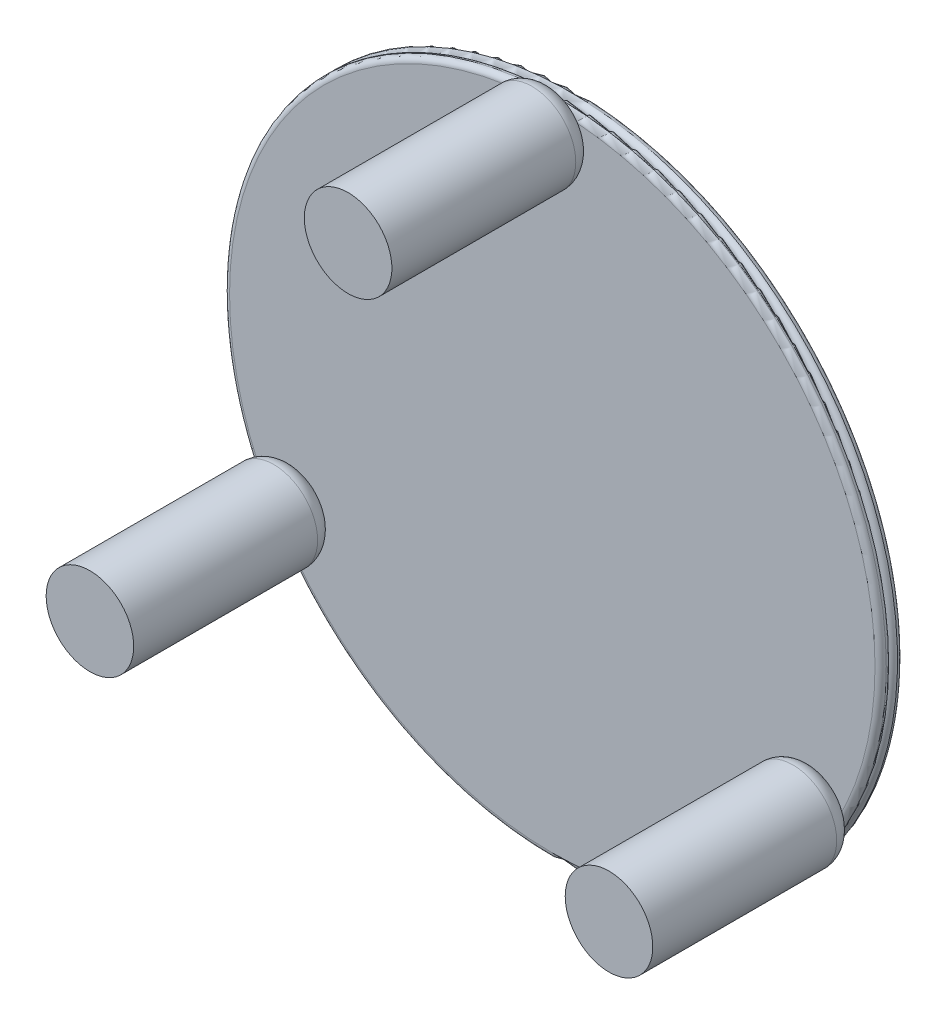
ISO-10303-21;
HEADER;
FILE_DESCRIPTION(('STEP AP214'),'2;1');
FILE_NAME('part.step','',(''),(''),'','','');
FILE_SCHEMA(('AUTOMOTIVE_DESIGN { 1 0 10303 214 1 1 1 1 }'));
ENDSEC;
DATA;
#1=APPLICATION_CONTEXT('core data for automotive mechanical design processes');
#2=APPLICATION_PROTOCOL_DEFINITION('international standard','automotive_design',2000,#1);
#3=PRODUCT_CONTEXT('',#1,'mechanical');
#4=PRODUCT('Part','Part','',(#3));
#5=PRODUCT_RELATED_PRODUCT_CATEGORY('part','',(#4));
#6=PRODUCT_DEFINITION_FORMATION('','',#4);
#7=PRODUCT_DEFINITION_CONTEXT('part definition',#1,'design');
#8=PRODUCT_DEFINITION('design','',#6,#7);
#9=PRODUCT_DEFINITION_SHAPE('','',#8);
#10=(LENGTH_UNIT() NAMED_UNIT(*) SI_UNIT(.MILLI.,.METRE.));
#11=(NAMED_UNIT(*) PLANE_ANGLE_UNIT() SI_UNIT($,.RADIAN.));
#12=(NAMED_UNIT(*) SI_UNIT($,.STERADIAN.) SOLID_ANGLE_UNIT());
#13=UNCERTAINTY_MEASURE_WITH_UNIT(LENGTH_MEASURE(1.E-05),#10,'distance_accuracy_value','');
#14=(GEOMETRIC_REPRESENTATION_CONTEXT(3) GLOBAL_UNCERTAINTY_ASSIGNED_CONTEXT((#13)) GLOBAL_UNIT_ASSIGNED_CONTEXT((#10,
#11,#12)) REPRESENTATION_CONTEXT('',''));
#15=CARTESIAN_POINT('',(0.,0.,0.));
#16=DIRECTION('',(0.,0.,1.));
#17=DIRECTION('',(1.,0.,0.));
#18=AXIS2_PLACEMENT_3D('',#15,#16,#17);
#19=CARTESIAN_POINT('',(-681.357062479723,-207.188704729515,18.));
#20=DIRECTION('',(0.,0.,1.));
#21=DIRECTION('',(1.,0.,0.));
#22=AXIS2_PLACEMENT_3D('',#19,#20,#21);
#23=PLANE('',#22);
#24=CARTESIAN_POINT('',(-681.357062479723,-207.188704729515,18.));
#25=DIRECTION('',(0.,0.,1.));
#26=DIRECTION('',(1.,0.,0.));
#27=AXIS2_PLACEMENT_3D('',#24,#25,#26);
#28=CIRCLE('',#27,40.0000000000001);
#29=CARTESIAN_POINT('',(-641.357062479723,-207.188704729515,18.));
#30=VERTEX_POINT('',#29);
#31=EDGE_CURVE('E11',#30,#30,#28,.F.);
#32=ORIENTED_EDGE('',*,*,#31,.T.);
#33=EDGE_LOOP('',(#32));
#34=FACE_BOUND('',#33,.T.);
#35=ADVANCED_FACE('F58',(#34),#23,.F.);
#36=CARTESIAN_POINT('',(-681.357062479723,-207.188704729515,899.989898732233));
#37=DIRECTION('',(0.,0.,-1.));
#38=DIRECTION('',(-1.,0.,0.));
#39=AXIS2_PLACEMENT_3D('',#36,#37,#38);
#40=CYLINDRICAL_SURFACE('',#39,70.0000000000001);
#41=CARTESIAN_POINT('',(-681.357062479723,-207.188704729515,47.9999999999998));
#42=DIRECTION('',(0.,0.,1.));
#43=DIRECTION('',(1.,0.,0.));
#44=AXIS2_PLACEMENT_3D('',#41,#42,#43);
#45=CIRCLE('',#44,70.0000000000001);
#46=CARTESIAN_POINT('',(-751.357062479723,-207.188704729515,47.9999999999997));
#47=VERTEX_POINT('',#46);
#48=EDGE_CURVE('E66',#47,#47,#45,.T.);
#49=CARTESIAN_POINT('',(-681.357062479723,-207.188704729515,342.));
#50=DIRECTION('',(0.,0.,-1.));
#51=DIRECTION('',(-1.,0.,0.));
#52=AXIS2_PLACEMENT_3D('',#49,#50,#51);
#53=CIRCLE('',#52,70.0000000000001);
#54=CARTESIAN_POINT('',(-751.357062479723,-207.188704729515,342.));
#55=VERTEX_POINT('',#54);
#56=EDGE_CURVE('E72',#55,#55,#53,.T.);
#57=CARTESIAN_POINT('',(-751.357062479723,-207.188704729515,47.9999999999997));
#58=CARTESIAN_POINT('',(-751.357062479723,-207.188704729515,51.0624999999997));
#59=CARTESIAN_POINT('',(-751.357062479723,-207.188704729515,54.1249999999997));
#60=CARTESIAN_POINT('',(-751.357062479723,-207.188704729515,60.2499999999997));
#61=CARTESIAN_POINT('',(-751.357062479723,-207.188704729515,63.3124999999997));
#62=CARTESIAN_POINT('',(-751.357062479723,-207.188704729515,69.4374999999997));
#63=CARTESIAN_POINT('',(-751.357062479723,-207.188704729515,72.4999999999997));
#64=CARTESIAN_POINT('',(-751.357062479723,-207.188704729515,78.6249999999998));
#65=CARTESIAN_POINT('',(-751.357062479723,-207.188704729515,81.6874999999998));
#66=CARTESIAN_POINT('',(-751.357062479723,-207.188704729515,87.8124999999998));
#67=CARTESIAN_POINT('',(-751.357062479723,-207.188704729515,90.8749999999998));
#68=CARTESIAN_POINT('',(-751.357062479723,-207.188704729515,96.9999999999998));
#69=CARTESIAN_POINT('',(-751.357062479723,-207.188704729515,100.0625));
#70=CARTESIAN_POINT('',(-751.357062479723,-207.188704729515,106.1875));
#71=CARTESIAN_POINT('',(-751.357062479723,-207.188704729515,109.25));
#72=CARTESIAN_POINT('',(-751.357062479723,-207.188704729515,115.375));
#73=CARTESIAN_POINT('',(-751.357062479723,-207.188704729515,118.4375));
#74=CARTESIAN_POINT('',(-751.357062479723,-207.188704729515,124.5625));
#75=CARTESIAN_POINT('',(-751.357062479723,-207.188704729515,127.625));
#76=CARTESIAN_POINT('',(-751.357062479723,-207.188704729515,133.75));
#77=CARTESIAN_POINT('',(-751.357062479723,-207.188704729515,136.8125));
#78=CARTESIAN_POINT('',(-751.357062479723,-207.188704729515,142.9375));
#79=CARTESIAN_POINT('',(-751.357062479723,-207.188704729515,146.));
#80=CARTESIAN_POINT('',(-751.357062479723,-207.188704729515,152.125));
#81=CARTESIAN_POINT('',(-751.357062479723,-207.188704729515,155.1875));
#82=CARTESIAN_POINT('',(-751.357062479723,-207.188704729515,161.3125));
#83=CARTESIAN_POINT('',(-751.357062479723,-207.188704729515,164.375));
#84=CARTESIAN_POINT('',(-751.357062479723,-207.188704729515,170.5));
#85=CARTESIAN_POINT('',(-751.357062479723,-207.188704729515,173.5625));
#86=CARTESIAN_POINT('',(-751.357062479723,-207.188704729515,179.6875));
#87=CARTESIAN_POINT('',(-751.357062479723,-207.188704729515,182.75));
#88=CARTESIAN_POINT('',(-751.357062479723,-207.188704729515,188.875));
#89=CARTESIAN_POINT('',(-751.357062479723,-207.188704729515,191.9375));
#90=CARTESIAN_POINT('',(-751.357062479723,-207.188704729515,198.0625));
#91=CARTESIAN_POINT('',(-751.357062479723,-207.188704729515,201.125));
#92=CARTESIAN_POINT('',(-751.357062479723,-207.188704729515,207.25));
#93=CARTESIAN_POINT('',(-751.357062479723,-207.188704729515,210.3125));
#94=CARTESIAN_POINT('',(-751.357062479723,-207.188704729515,216.4375));
#95=CARTESIAN_POINT('',(-751.357062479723,-207.188704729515,219.5));
#96=CARTESIAN_POINT('',(-751.357062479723,-207.188704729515,225.625));
#97=CARTESIAN_POINT('',(-751.357062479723,-207.188704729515,228.6875));
#98=CARTESIAN_POINT('',(-751.357062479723,-207.188704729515,234.8125));
#99=CARTESIAN_POINT('',(-751.357062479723,-207.188704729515,237.875));
#100=CARTESIAN_POINT('',(-751.357062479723,-207.188704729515,244.));
#101=CARTESIAN_POINT('',(-751.357062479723,-207.188704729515,247.0625));
#102=CARTESIAN_POINT('',(-751.357062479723,-207.188704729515,253.1875));
#103=CARTESIAN_POINT('',(-751.357062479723,-207.188704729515,256.25));
#104=CARTESIAN_POINT('',(-751.357062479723,-207.188704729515,262.375));
#105=CARTESIAN_POINT('',(-751.357062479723,-207.188704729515,265.4375));
#106=CARTESIAN_POINT('',(-751.357062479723,-207.188704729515,271.5625));
#107=CARTESIAN_POINT('',(-751.357062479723,-207.188704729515,274.625));
#108=CARTESIAN_POINT('',(-751.357062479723,-207.188704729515,280.75));
#109=CARTESIAN_POINT('',(-751.357062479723,-207.188704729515,283.8125));
#110=CARTESIAN_POINT('',(-751.357062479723,-207.188704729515,289.9375));
#111=CARTESIAN_POINT('',(-751.357062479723,-207.188704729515,293.));
#112=CARTESIAN_POINT('',(-751.357062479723,-207.188704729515,299.125));
#113=CARTESIAN_POINT('',(-751.357062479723,-207.188704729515,302.1875));
#114=CARTESIAN_POINT('',(-751.357062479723,-207.188704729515,308.3125));
#115=CARTESIAN_POINT('',(-751.357062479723,-207.188704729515,311.375));
#116=CARTESIAN_POINT('',(-751.357062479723,-207.188704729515,317.5));
#117=CARTESIAN_POINT('',(-751.357062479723,-207.188704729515,320.5625));
#118=CARTESIAN_POINT('',(-751.357062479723,-207.188704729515,326.6875));
#119=CARTESIAN_POINT('',(-751.357062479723,-207.188704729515,329.75));
#120=CARTESIAN_POINT('',(-751.357062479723,-207.188704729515,335.875));
#121=CARTESIAN_POINT('',(-751.357062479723,-207.188704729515,338.9375));
#122=CARTESIAN_POINT('',(-751.357062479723,-207.188704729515,342.));
#123=B_SPLINE_CURVE_WITH_KNOTS('',3,(#57,#58,#59,#60,#61,#62,#63,#64,#65,#66,#67,#68,#69,#70,
#71,#72,#73,#74,#75,#76,#77,#78,#79,#80,#81,#82,#83,#84,#85,#86,#87,#88,#89,#90,#91,#92,#93,#94,
#95,#96,#97,#98,#99,#100,#101,#102,#103,#104,#105,#106,#107,#108,#109,#110,#111,#112,#113,#114,
#115,#116,#117,#118,#119,#120,#121,#122),.UNSPECIFIED.,.F.,.F.,(4,2,2,2,2,2,2,2,2,2,2,2,2,2,2,2,
2,2,2,2,2,2,2,2,2,2,2,2,2,2,2,2,4),(0.,9.18750000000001,18.375,27.5625,36.7500000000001,
45.9375000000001,55.1250000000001,64.3125,73.5000000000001,82.6875,91.875,101.0625,110.25,
119.4375,128.625,137.8125,147.,156.1875,165.375,174.5625,183.75,192.9375,202.125,211.3125,220.5,
229.6875,238.875,248.0625,257.25,266.4375,275.625,284.8125,294.),.UNSPECIFIED.);
#124=EDGE_CURVE('BSEAM79',#47,#55,#123,.T.);
#125=ORIENTED_EDGE('',*,*,#48,.T.);
#126=ORIENTED_EDGE('',*,*,#56,.T.);
#127=ORIENTED_EDGE('',*,*,#124,.T.);
#128=ORIENTED_EDGE('',*,*,#124,.F.);
#129=EDGE_LOOP('',(#125,#127,#126,#128));
#130=FACE_BOUND('',#129,.T.);
#131=ADVANCED_FACE('F79',(#130),#40,.T.);
#132=CARTESIAN_POINT('',(-266.11981026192,33.5975581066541,342.));
#133=DIRECTION('',(0.,0.,-1.));
#134=DIRECTION('',(-1.,0.,0.));
#135=AXIS2_PLACEMENT_3D('',#132,#133,#134);
#136=PLANE('',#135);
#137=ORIENTED_EDGE('',*,*,#56,.F.);
#138=EDGE_LOOP('',(#137));
#139=FACE_BOUND('',#138,.T.);
#140=ADVANCED_FACE('F81',(#139),#136,.F.);
#141=CARTESIAN_POINT('',(-681.357062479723,-207.188704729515,48.));
#142=DIRECTION('',(0.,0.,1.));
#143=DIRECTION('',(1.,0.,0.));
#144=AXIS2_PLACEMENT_3D('',#141,#142,#143);
#145=TOROIDAL_SURFACE('',#144,40.0000000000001,30.);
#146=ORIENTED_EDGE('',*,*,#31,.F.);
#147=EDGE_LOOP('',(#146));
#148=FACE_BOUND('',#147,.T.);
#149=ORIENTED_EDGE('',*,*,#48,.F.);
#150=EDGE_LOOP('',(#149));
#151=FACE_BOUND('',#150,.T.);
#152=ADVANCED_FACE('F60',(#148,#151),#145,.T.);
#153=CLOSED_SHELL('',(#35,#131,#140,#152));
#154=MANIFOLD_SOLID_BREP('B2',#153);
#155=CARTESIAN_POINT('',(148.561038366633,-208.145681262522,18.));
#156=DIRECTION('',(0.,0.,1.));
#157=DIRECTION('',(1.,0.,0.));
#158=AXIS2_PLACEMENT_3D('',#155,#156,#157);
#159=PLANE('',#158);
#160=CARTESIAN_POINT('',(148.561038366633,-208.145681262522,18.));
#161=DIRECTION('',(0.,0.,1.));
#162=DIRECTION('',(1.,0.,0.));
#163=AXIS2_PLACEMENT_3D('',#160,#161,#162);
#164=CIRCLE('',#163,40.);
#165=CARTESIAN_POINT('',(188.561038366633,-208.145681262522,18.));
#166=VERTEX_POINT('',#165);
#167=EDGE_CURVE('E57',#166,#166,#164,.F.);
#168=ORIENTED_EDGE('',*,*,#167,.T.);
#169=EDGE_LOOP('',(#168));
#170=FACE_BOUND('',#169,.T.);
#171=ADVANCED_FACE('F129',(#170),#159,.F.);
#172=CARTESIAN_POINT('',(148.561038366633,-208.145681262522,899.989898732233));
#173=DIRECTION('',(0.,0.,-1.));
#174=DIRECTION('',(-1.,0.,0.));
#175=AXIS2_PLACEMENT_3D('',#172,#173,#174);
#176=CYLINDRICAL_SURFACE('',#175,70.);
#177=CARTESIAN_POINT('',(148.561038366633,-208.145681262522,47.9999999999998));
#178=DIRECTION('',(0.,0.,1.));
#179=DIRECTION('',(1.,0.,0.));
#180=AXIS2_PLACEMENT_3D('',#177,#178,#179);
#181=CIRCLE('',#180,70.);
#182=CARTESIAN_POINT('',(78.5610383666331,-208.145681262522,47.9999999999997));
#183=VERTEX_POINT('',#182);
#184=EDGE_CURVE('E137',#183,#183,#181,.T.);
#185=CARTESIAN_POINT('',(148.561038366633,-208.145681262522,342.));
#186=DIRECTION('',(0.,0.,-1.));
#187=DIRECTION('',(-1.,0.,0.));
#188=AXIS2_PLACEMENT_3D('',#185,#186,#187);
#189=CIRCLE('',#188,70.);
#190=CARTESIAN_POINT('',(78.5610383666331,-208.145681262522,342.));
#191=VERTEX_POINT('',#190);
#192=EDGE_CURVE('E143',#191,#191,#189,.T.);
#193=CARTESIAN_POINT('',(78.5610383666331,-208.145681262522,47.9999999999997));
#194=CARTESIAN_POINT('',(78.5610383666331,-208.145681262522,51.0624999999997));
#195=CARTESIAN_POINT('',(78.5610383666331,-208.145681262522,54.1249999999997));
#196=CARTESIAN_POINT('',(78.5610383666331,-208.145681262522,60.2499999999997));
#197=CARTESIAN_POINT('',(78.5610383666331,-208.145681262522,63.3124999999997));
#198=CARTESIAN_POINT('',(78.5610383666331,-208.145681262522,69.4374999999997));
#199=CARTESIAN_POINT('',(78.5610383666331,-208.145681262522,72.4999999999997));
#200=CARTESIAN_POINT('',(78.5610383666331,-208.145681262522,78.6249999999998));
#201=CARTESIAN_POINT('',(78.5610383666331,-208.145681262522,81.6874999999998));
#202=CARTESIAN_POINT('',(78.5610383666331,-208.145681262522,87.8124999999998));
#203=CARTESIAN_POINT('',(78.5610383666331,-208.145681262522,90.8749999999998));
#204=CARTESIAN_POINT('',(78.5610383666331,-208.145681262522,96.9999999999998));
#205=CARTESIAN_POINT('',(78.5610383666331,-208.145681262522,100.0625));
#206=CARTESIAN_POINT('',(78.5610383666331,-208.145681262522,106.1875));
#207=CARTESIAN_POINT('',(78.5610383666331,-208.145681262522,109.25));
#208=CARTESIAN_POINT('',(78.5610383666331,-208.145681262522,115.375));
#209=CARTESIAN_POINT('',(78.5610383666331,-208.145681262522,118.4375));
#210=CARTESIAN_POINT('',(78.5610383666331,-208.145681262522,124.5625));
#211=CARTESIAN_POINT('',(78.5610383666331,-208.145681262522,127.625));
#212=CARTESIAN_POINT('',(78.5610383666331,-208.145681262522,133.75));
#213=CARTESIAN_POINT('',(78.5610383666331,-208.145681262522,136.8125));
#214=CARTESIAN_POINT('',(78.5610383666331,-208.145681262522,142.9375));
#215=CARTESIAN_POINT('',(78.5610383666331,-208.145681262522,146.));
#216=CARTESIAN_POINT('',(78.5610383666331,-208.145681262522,152.125));
#217=CARTESIAN_POINT('',(78.5610383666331,-208.145681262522,155.1875));
#218=CARTESIAN_POINT('',(78.5610383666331,-208.145681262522,161.3125));
#219=CARTESIAN_POINT('',(78.5610383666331,-208.145681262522,164.375));
#220=CARTESIAN_POINT('',(78.5610383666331,-208.145681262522,170.5));
#221=CARTESIAN_POINT('',(78.5610383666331,-208.145681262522,173.5625));
#222=CARTESIAN_POINT('',(78.5610383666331,-208.145681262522,179.6875));
#223=CARTESIAN_POINT('',(78.5610383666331,-208.145681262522,182.75));
#224=CARTESIAN_POINT('',(78.5610383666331,-208.145681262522,188.875));
#225=CARTESIAN_POINT('',(78.5610383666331,-208.145681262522,191.9375));
#226=CARTESIAN_POINT('',(78.5610383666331,-208.145681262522,198.0625));
#227=CARTESIAN_POINT('',(78.5610383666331,-208.145681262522,201.125));
#228=CARTESIAN_POINT('',(78.5610383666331,-208.145681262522,207.25));
#229=CARTESIAN_POINT('',(78.5610383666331,-208.145681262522,210.3125));
#230=CARTESIAN_POINT('',(78.5610383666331,-208.145681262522,216.4375));
#231=CARTESIAN_POINT('',(78.5610383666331,-208.145681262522,219.5));
#232=CARTESIAN_POINT('',(78.5610383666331,-208.145681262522,225.625));
#233=CARTESIAN_POINT('',(78.5610383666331,-208.145681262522,228.6875));
#234=CARTESIAN_POINT('',(78.5610383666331,-208.145681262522,234.8125));
#235=CARTESIAN_POINT('',(78.5610383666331,-208.145681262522,237.875));
#236=CARTESIAN_POINT('',(78.5610383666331,-208.145681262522,244.));
#237=CARTESIAN_POINT('',(78.5610383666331,-208.145681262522,247.0625));
#238=CARTESIAN_POINT('',(78.5610383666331,-208.145681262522,253.1875));
#239=CARTESIAN_POINT('',(78.5610383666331,-208.145681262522,256.25));
#240=CARTESIAN_POINT('',(78.5610383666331,-208.145681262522,262.375));
#241=CARTESIAN_POINT('',(78.5610383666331,-208.145681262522,265.4375));
#242=CARTESIAN_POINT('',(78.5610383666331,-208.145681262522,271.5625));
#243=CARTESIAN_POINT('',(78.5610383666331,-208.145681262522,274.625));
#244=CARTESIAN_POINT('',(78.5610383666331,-208.145681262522,280.75));
#245=CARTESIAN_POINT('',(78.5610383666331,-208.145681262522,283.8125));
#246=CARTESIAN_POINT('',(78.5610383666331,-208.145681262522,289.9375));
#247=CARTESIAN_POINT('',(78.5610383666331,-208.145681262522,293.));
#248=CARTESIAN_POINT('',(78.5610383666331,-208.145681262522,299.125));
#249=CARTESIAN_POINT('',(78.5610383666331,-208.145681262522,302.1875));
#250=CARTESIAN_POINT('',(78.5610383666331,-208.145681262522,308.3125));
#251=CARTESIAN_POINT('',(78.5610383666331,-208.145681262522,311.375));
#252=CARTESIAN_POINT('',(78.5610383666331,-208.145681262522,317.5));
#253=CARTESIAN_POINT('',(78.5610383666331,-208.145681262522,320.5625));
#254=CARTESIAN_POINT('',(78.5610383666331,-208.145681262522,326.6875));
#255=CARTESIAN_POINT('',(78.5610383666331,-208.145681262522,329.75));
#256=CARTESIAN_POINT('',(78.5610383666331,-208.145681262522,335.875));
#257=CARTESIAN_POINT('',(78.5610383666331,-208.145681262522,338.9375));
#258=CARTESIAN_POINT('',(78.5610383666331,-208.145681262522,342.));
#259=B_SPLINE_CURVE_WITH_KNOTS('',3,(#193,#194,#195,#196,#197,#198,#199,#200,#201,#202,#203,
#204,#205,#206,#207,#208,#209,#210,#211,#212,#213,#214,#215,#216,#217,#218,#219,#220,#221,#222,
#223,#224,#225,#226,#227,#228,#229,#230,#231,#232,#233,#234,#235,#236,#237,#238,#239,#240,#241,
#242,#243,#244,#245,#246,#247,#248,#249,#250,#251,#252,#253,#254,#255,#256,#257,#258),
.UNSPECIFIED.,.F.,.F.,(4,2,2,2,2,2,2,2,2,2,2,2,2,2,2,2,2,2,2,2,2,2,2,2,2,2,2,2,2,2,2,2,4),(0.,
9.18750000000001,18.375,27.5625,36.7500000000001,45.9375000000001,55.1250000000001,64.3125,
73.5000000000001,82.6875,91.875,101.0625,110.25,119.4375,128.625,137.8125,147.,156.1875,165.375,
174.5625,183.75,192.9375,202.125,211.3125,220.5,229.6875,238.875,248.0625,257.25,266.4375,
275.625,284.8125,294.),.UNSPECIFIED.);
#260=EDGE_CURVE('BSEAM150',#183,#191,#259,.T.);
#261=ORIENTED_EDGE('',*,*,#184,.T.);
#262=ORIENTED_EDGE('',*,*,#192,.T.);
#263=ORIENTED_EDGE('',*,*,#260,.T.);
#264=ORIENTED_EDGE('',*,*,#260,.F.);
#265=EDGE_LOOP('',(#261,#263,#262,#264));
#266=FACE_BOUND('',#265,.T.);
#267=ADVANCED_FACE('F150',(#266),#176,.T.);
#268=CARTESIAN_POINT('',(-266.11981026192,33.5975581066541,342.));
#269=DIRECTION('',(0.,0.,-1.));
#270=DIRECTION('',(-1.,0.,0.));
#271=AXIS2_PLACEMENT_3D('',#268,#269,#270);
#272=PLANE('',#271);
#273=ORIENTED_EDGE('',*,*,#192,.F.);
#274=EDGE_LOOP('',(#273));
#275=FACE_BOUND('',#274,.T.);
#276=ADVANCED_FACE('F152',(#275),#272,.F.);
#277=CARTESIAN_POINT('',(148.561038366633,-208.145681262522,48.));
#278=DIRECTION('',(0.,0.,1.));
#279=DIRECTION('',(1.,0.,0.));
#280=AXIS2_PLACEMENT_3D('',#277,#278,#279);
#281=TOROIDAL_SURFACE('',#280,40.,30.);
#282=ORIENTED_EDGE('',*,*,#167,.F.);
#283=EDGE_LOOP('',(#282));
#284=FACE_BOUND('',#283,.T.);
#285=ORIENTED_EDGE('',*,*,#184,.F.);
#286=EDGE_LOOP('',(#285));
#287=FACE_BOUND('',#286,.T.);
#288=ADVANCED_FACE('F131',(#284,#287),#281,.T.);
#289=CLOSED_SHELL('',(#171,#267,#276,#288));
#290=MANIFOLD_SOLID_BREP('B6',#289);
#291=CARTESIAN_POINT('',(-268.580289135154,522.775754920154,18.));
#292=DIRECTION('',(0.,0.,1.));
#293=DIRECTION('',(1.,0.,0.));
#294=AXIS2_PLACEMENT_3D('',#291,#292,#293);
#295=PLANE('',#294);
#296=CARTESIAN_POINT('',(-268.580289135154,522.775754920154,18.));
#297=DIRECTION('',(0.,0.,1.));
#298=DIRECTION('',(1.,0.,0.));
#299=AXIS2_PLACEMENT_3D('',#296,#297,#298);
#300=CIRCLE('',#299,40.0000000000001);
#301=CARTESIAN_POINT('',(-228.580289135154,522.775754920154,18.));
#302=VERTEX_POINT('',#301);
#303=EDGE_CURVE('E128',#302,#302,#300,.F.);
#304=ORIENTED_EDGE('',*,*,#303,.T.);
#305=EDGE_LOOP('',(#304));
#306=FACE_BOUND('',#305,.T.);
#307=ADVANCED_FACE('F201',(#306),#295,.F.);
#308=CARTESIAN_POINT('',(-268.580289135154,522.775754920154,899.989898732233));
#309=DIRECTION('',(0.,0.,-1.));
#310=DIRECTION('',(-1.,0.,0.));
#311=AXIS2_PLACEMENT_3D('',#308,#309,#310);
#312=CYLINDRICAL_SURFACE('',#311,70.0000000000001);
#313=CARTESIAN_POINT('',(-268.580289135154,522.775754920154,47.9999999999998));
#314=DIRECTION('',(0.,0.,1.));
#315=DIRECTION('',(1.,0.,0.));
#316=AXIS2_PLACEMENT_3D('',#313,#314,#315);
#317=CIRCLE('',#316,70.0000000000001);
#318=CARTESIAN_POINT('',(-338.580289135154,522.775754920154,47.9999999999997));
#319=VERTEX_POINT('',#318);
#320=EDGE_CURVE('E209',#319,#319,#317,.T.);
#321=CARTESIAN_POINT('',(-268.580289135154,522.775754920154,342.));
#322=DIRECTION('',(0.,0.,-1.));
#323=DIRECTION('',(-1.,0.,0.));
#324=AXIS2_PLACEMENT_3D('',#321,#322,#323);
#325=CIRCLE('',#324,70.0000000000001);
#326=CARTESIAN_POINT('',(-338.580289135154,522.775754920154,342.));
#327=VERTEX_POINT('',#326);
#328=EDGE_CURVE('E215',#327,#327,#325,.T.);
#329=CARTESIAN_POINT('',(-338.580289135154,522.775754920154,47.9999999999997));
#330=CARTESIAN_POINT('',(-338.580289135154,522.775754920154,51.0624999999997));
#331=CARTESIAN_POINT('',(-338.580289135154,522.775754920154,54.1249999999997));
#332=CARTESIAN_POINT('',(-338.580289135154,522.775754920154,60.2499999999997));
#333=CARTESIAN_POINT('',(-338.580289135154,522.775754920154,63.3124999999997));
#334=CARTESIAN_POINT('',(-338.580289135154,522.775754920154,69.4374999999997));
#335=CARTESIAN_POINT('',(-338.580289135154,522.775754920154,72.4999999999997));
#336=CARTESIAN_POINT('',(-338.580289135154,522.775754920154,78.6249999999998));
#337=CARTESIAN_POINT('',(-338.580289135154,522.775754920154,81.6874999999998));
#338=CARTESIAN_POINT('',(-338.580289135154,522.775754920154,87.8124999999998));
#339=CARTESIAN_POINT('',(-338.580289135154,522.775754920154,90.8749999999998));
#340=CARTESIAN_POINT('',(-338.580289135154,522.775754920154,96.9999999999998));
#341=CARTESIAN_POINT('',(-338.580289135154,522.775754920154,100.0625));
#342=CARTESIAN_POINT('',(-338.580289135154,522.775754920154,106.1875));
#343=CARTESIAN_POINT('',(-338.580289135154,522.775754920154,109.25));
#344=CARTESIAN_POINT('',(-338.580289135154,522.775754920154,115.375));
#345=CARTESIAN_POINT('',(-338.580289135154,522.775754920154,118.4375));
#346=CARTESIAN_POINT('',(-338.580289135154,522.775754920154,124.5625));
#347=CARTESIAN_POINT('',(-338.580289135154,522.775754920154,127.625));
#348=CARTESIAN_POINT('',(-338.580289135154,522.775754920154,133.75));
#349=CARTESIAN_POINT('',(-338.580289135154,522.775754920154,136.8125));
#350=CARTESIAN_POINT('',(-338.580289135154,522.775754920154,142.9375));
#351=CARTESIAN_POINT('',(-338.580289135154,522.775754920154,146.));
#352=CARTESIAN_POINT('',(-338.580289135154,522.775754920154,152.125));
#353=CARTESIAN_POINT('',(-338.580289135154,522.775754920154,155.1875));
#354=CARTESIAN_POINT('',(-338.580289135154,522.775754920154,161.3125));
#355=CARTESIAN_POINT('',(-338.580289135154,522.775754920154,164.375));
#356=CARTESIAN_POINT('',(-338.580289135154,522.775754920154,170.5));
#357=CARTESIAN_POINT('',(-338.580289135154,522.775754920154,173.5625));
#358=CARTESIAN_POINT('',(-338.580289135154,522.775754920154,179.6875));
#359=CARTESIAN_POINT('',(-338.580289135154,522.775754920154,182.75));
#360=CARTESIAN_POINT('',(-338.580289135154,522.775754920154,188.875));
#361=CARTESIAN_POINT('',(-338.580289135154,522.775754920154,191.9375));
#362=CARTESIAN_POINT('',(-338.580289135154,522.775754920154,198.0625));
#363=CARTESIAN_POINT('',(-338.580289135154,522.775754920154,201.125));
#364=CARTESIAN_POINT('',(-338.580289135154,522.775754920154,207.25));
#365=CARTESIAN_POINT('',(-338.580289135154,522.775754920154,210.3125));
#366=CARTESIAN_POINT('',(-338.580289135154,522.775754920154,216.4375));
#367=CARTESIAN_POINT('',(-338.580289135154,522.775754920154,219.5));
#368=CARTESIAN_POINT('',(-338.580289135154,522.775754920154,225.625));
#369=CARTESIAN_POINT('',(-338.580289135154,522.775754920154,228.6875));
#370=CARTESIAN_POINT('',(-338.580289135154,522.775754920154,234.8125));
#371=CARTESIAN_POINT('',(-338.580289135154,522.775754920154,237.875));
#372=CARTESIAN_POINT('',(-338.580289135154,522.775754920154,244.));
#373=CARTESIAN_POINT('',(-338.580289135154,522.775754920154,247.0625));
#374=CARTESIAN_POINT('',(-338.580289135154,522.775754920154,253.1875));
#375=CARTESIAN_POINT('',(-338.580289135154,522.775754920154,256.25));
#376=CARTESIAN_POINT('',(-338.580289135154,522.775754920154,262.375));
#377=CARTESIAN_POINT('',(-338.580289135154,522.775754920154,265.4375));
#378=CARTESIAN_POINT('',(-338.580289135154,522.775754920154,271.5625));
#379=CARTESIAN_POINT('',(-338.580289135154,522.775754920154,274.625));
#380=CARTESIAN_POINT('',(-338.580289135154,522.775754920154,280.75));
#381=CARTESIAN_POINT('',(-338.580289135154,522.775754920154,283.8125));
#382=CARTESIAN_POINT('',(-338.580289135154,522.775754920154,289.9375));
#383=CARTESIAN_POINT('',(-338.580289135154,522.775754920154,293.));
#384=CARTESIAN_POINT('',(-338.580289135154,522.775754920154,299.125));
#385=CARTESIAN_POINT('',(-338.580289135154,522.775754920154,302.1875));
#386=CARTESIAN_POINT('',(-338.580289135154,522.775754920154,308.3125));
#387=CARTESIAN_POINT('',(-338.580289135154,522.775754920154,311.375));
#388=CARTESIAN_POINT('',(-338.580289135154,522.775754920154,317.5));
#389=CARTESIAN_POINT('',(-338.580289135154,522.775754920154,320.5625));
#390=CARTESIAN_POINT('',(-338.580289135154,522.775754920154,326.6875));
#391=CARTESIAN_POINT('',(-338.580289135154,522.775754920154,329.75));
#392=CARTESIAN_POINT('',(-338.580289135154,522.775754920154,335.875));
#393=CARTESIAN_POINT('',(-338.580289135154,522.775754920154,338.9375));
#394=CARTESIAN_POINT('',(-338.580289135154,522.775754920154,342.));
#395=B_SPLINE_CURVE_WITH_KNOTS('',3,(#329,#330,#331,#332,#333,#334,#335,#336,#337,#338,#339,
#340,#341,#342,#343,#344,#345,#346,#347,#348,#349,#350,#351,#352,#353,#354,#355,#356,#357,#358,
#359,#360,#361,#362,#363,#364,#365,#366,#367,#368,#369,#370,#371,#372,#373,#374,#375,#376,#377,
#378,#379,#380,#381,#382,#383,#384,#385,#386,#387,#388,#389,#390,#391,#392,#393,#394),
.UNSPECIFIED.,.F.,.F.,(4,2,2,2,2,2,2,2,2,2,2,2,2,2,2,2,2,2,2,2,2,2,2,2,2,2,2,2,2,2,2,2,4),(0.,
9.18750000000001,18.375,27.5625,36.7500000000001,45.9375000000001,55.1250000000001,64.3125,
73.5000000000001,82.6875,91.875,101.0625,110.25,119.4375,128.625,137.8125,147.,156.1875,165.375,
174.5625,183.75,192.9375,202.125,211.3125,220.5,229.6875,238.875,248.0625,257.25,266.4375,
275.625,284.8125,294.),.UNSPECIFIED.);
#396=EDGE_CURVE('BSEAM222',#319,#327,#395,.T.);
#397=ORIENTED_EDGE('',*,*,#320,.T.);
#398=ORIENTED_EDGE('',*,*,#328,.T.);
#399=ORIENTED_EDGE('',*,*,#396,.T.);
#400=ORIENTED_EDGE('',*,*,#396,.F.);
#401=EDGE_LOOP('',(#397,#399,#398,#400));
#402=FACE_BOUND('',#401,.T.);
#403=ADVANCED_FACE('F222',(#402),#312,.T.);
#404=CARTESIAN_POINT('',(-266.11981026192,33.5975581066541,342.));
#405=DIRECTION('',(0.,0.,-1.));
#406=DIRECTION('',(-1.,0.,0.));
#407=AXIS2_PLACEMENT_3D('',#404,#405,#406);
#408=PLANE('',#407);
#409=ORIENTED_EDGE('',*,*,#328,.F.);
#410=EDGE_LOOP('',(#409));
#411=FACE_BOUND('',#410,.T.);
#412=ADVANCED_FACE('F224',(#411),#408,.F.);
#413=CARTESIAN_POINT('',(-268.580289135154,522.775754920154,48.));
#414=DIRECTION('',(0.,0.,1.));
#415=DIRECTION('',(1.,0.,0.));
#416=AXIS2_PLACEMENT_3D('',#413,#414,#415);
#417=TOROIDAL_SURFACE('',#416,40.0000000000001,30.);
#418=ORIENTED_EDGE('',*,*,#303,.F.);
#419=EDGE_LOOP('',(#418));
#420=FACE_BOUND('',#419,.T.);
#421=ORIENTED_EDGE('',*,*,#320,.F.);
#422=EDGE_LOOP('',(#421));
#423=FACE_BOUND('',#422,.T.);
#424=ADVANCED_FACE('F203',(#420,#423),#417,.T.);
#425=CLOSED_SHELL('',(#307,#403,#412,#424));
#426=MANIFOLD_SOLID_BREP('B52',#425);
#427=CARTESIAN_POINT('',(-266.11981026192,33.5975581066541,-18.));
#428=DIRECTION('',(0.,0.,-1.));
#429=DIRECTION('',(-1.,0.,0.));
#430=AXIS2_PLACEMENT_3D('',#427,#428,#429);
#431=PLANE('',#430);
#432=CARTESIAN_POINT('',(-266.11981026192,33.5975581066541,-18.));
#433=DIRECTION('',(0.,0.,-1.));
#434=DIRECTION('',(-1.,0.,0.));
#435=AXIS2_PLACEMENT_3D('',#432,#433,#434);
#436=CIRCLE('',#435,516.);
#437=CARTESIAN_POINT('',(-782.11981026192,33.5975581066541,-18.));
#438=VERTEX_POINT('',#437);
#439=EDGE_CURVE('E281',#438,#438,#436,.T.);
#440=ORIENTED_EDGE('',*,*,#439,.T.);
#441=EDGE_LOOP('',(#440));
#442=FACE_BOUND('',#441,.T.);
#443=ADVANCED_FACE('F272',(#442),#431,.T.);
#444=CARTESIAN_POINT('',(-266.11981026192,33.5975581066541,0.));
#445=DIRECTION('',(0.,0.,-1.));
#446=DIRECTION('',(-1.,0.,0.));
#447=AXIS2_PLACEMENT_3D('',#444,#445,#446);
#448=PLANE('',#447);
#449=CARTESIAN_POINT('',(-266.11981026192,33.5975581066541,0.));
#450=DIRECTION('',(0.,0.,-1.));
#451=DIRECTION('',(-1.,0.,0.));
#452=AXIS2_PLACEMENT_3D('',#449,#450,#451);
#453=CIRCLE('',#452,516.);
#454=CARTESIAN_POINT('',(-782.11981026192,33.5975581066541,0.));
#455=VERTEX_POINT('',#454);
#456=EDGE_CURVE('E200',#455,#455,#453,.F.);
#457=ORIENTED_EDGE('',*,*,#456,.T.);
#458=EDGE_LOOP('',(#457));
#459=FACE_BOUND('',#458,.T.);
#460=ADVANCED_FACE('F298',(#459),#448,.F.);
#461=CARTESIAN_POINT('',(-266.11981026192,33.5975581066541,-9.));
#462=DIRECTION('',(0.,0.,-1.));
#463=DIRECTION('',(-1.,0.,0.));
#464=AXIS2_PLACEMENT_3D('',#461,#462,#463);
#465=TOROIDAL_SURFACE('',#464,516.,9.);
#466=ORIENTED_EDGE('',*,*,#456,.F.);
#467=EDGE_LOOP('',(#466));
#468=FACE_BOUND('',#467,.T.);
#469=CARTESIAN_POINT('',(-266.11981026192,33.5975581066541,-9.));
#470=DIRECTION('',(0.,0.,-1.));
#471=DIRECTION('',(-1.,0.,0.));
#472=AXIS2_PLACEMENT_3D('',#469,#470,#471);
#473=CIRCLE('',#472,525.);
#474=CARTESIAN_POINT('',(-791.11981026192,33.5975581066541,-9.));
#475=VERTEX_POINT('',#474);
#476=EDGE_CURVE('E276',#475,#475,#473,.T.);
#477=ORIENTED_EDGE('',*,*,#476,.F.);
#478=EDGE_LOOP('',(#477));
#479=FACE_BOUND('',#478,.T.);
#480=ADVANCED_FACE('F274',(#468,#479),#465,.T.);
#481=CARTESIAN_POINT('',(-266.11981026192,33.5975581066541,-9.));
#482=DIRECTION('',(0.,0.,-1.));
#483=DIRECTION('',(-1.,0.,0.));
#484=AXIS2_PLACEMENT_3D('',#481,#482,#483);
#485=TOROIDAL_SURFACE('',#484,516.,9.);
#486=ORIENTED_EDGE('',*,*,#476,.T.);
#487=EDGE_LOOP('',(#486));
#488=FACE_BOUND('',#487,.T.);
#489=ORIENTED_EDGE('',*,*,#439,.F.);
#490=EDGE_LOOP('',(#489));
#491=FACE_BOUND('',#490,.T.);
#492=ADVANCED_FACE('F294',(#488,#491),#485,.T.);
#493=CLOSED_SHELL('',(#443,#460,#480,#492));
#494=MANIFOLD_SOLID_BREP('B123',#493);
#495=CARTESIAN_POINT('',(-266.11981026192,33.5975581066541,18.));
#496=DIRECTION('',(0.,0.,1.));
#497=DIRECTION('',(1.,0.,0.));
#498=AXIS2_PLACEMENT_3D('',#495,#496,#497);
#499=PLANE('',#498);
#500=CARTESIAN_POINT('',(-266.11981026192,33.5975581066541,18.));
#501=DIRECTION('',(0.,0.,1.));
#502=DIRECTION('',(1.,0.,0.));
#503=AXIS2_PLACEMENT_3D('',#500,#501,#502);
#504=CIRCLE('',#503,516.);
#505=CARTESIAN_POINT('',(249.88018973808,33.5975581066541,18.));
#506=VERTEX_POINT('',#505);
#507=EDGE_CURVE('E271',#506,#506,#504,.T.);
#508=ORIENTED_EDGE('',*,*,#507,.T.);
#509=EDGE_LOOP('',(#508));
#510=FACE_BOUND('',#509,.T.);
#511=ADVANCED_FACE('F337',(#510),#499,.T.);
#512=CARTESIAN_POINT('',(-266.11981026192,33.5975581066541,0.));
#513=DIRECTION('',(0.,0.,1.));
#514=DIRECTION('',(1.,0.,0.));
#515=AXIS2_PLACEMENT_3D('',#512,#513,#514);
#516=PLANE('',#515);
#517=CARTESIAN_POINT('',(-266.11981026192,33.5975581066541,0.));
#518=DIRECTION('',(0.,0.,1.));
#519=DIRECTION('',(1.,0.,0.));
#520=AXIS2_PLACEMENT_3D('',#517,#518,#519);
#521=CIRCLE('',#520,516.);
#522=CARTESIAN_POINT('',(249.88018973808,33.5975581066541,0.));
#523=VERTEX_POINT('',#522);
#524=EDGE_CURVE('E346',#523,#523,#521,.F.);
#525=ORIENTED_EDGE('',*,*,#524,.T.);
#526=EDGE_LOOP('',(#525));
#527=FACE_BOUND('',#526,.T.);
#528=ADVANCED_FACE('F364',(#527),#516,.F.);
#529=CARTESIAN_POINT('',(-266.11981026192,33.5975581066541,9.));
#530=DIRECTION('',(0.,0.,1.));
#531=DIRECTION('',(1.,0.,0.));
#532=AXIS2_PLACEMENT_3D('',#529,#530,#531);
#533=TOROIDAL_SURFACE('',#532,516.,9.);
#534=ORIENTED_EDGE('',*,*,#507,.F.);
#535=EDGE_LOOP('',(#534));
#536=FACE_BOUND('',#535,.T.);
#537=CARTESIAN_POINT('',(-266.11981026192,33.5975581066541,9.));
#538=DIRECTION('',(0.,0.,1.));
#539=DIRECTION('',(1.,0.,0.));
#540=AXIS2_PLACEMENT_3D('',#537,#538,#539);
#541=CIRCLE('',#540,525.);
#542=CARTESIAN_POINT('',(258.88018973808,33.5975581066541,9.));
#543=VERTEX_POINT('',#542);
#544=EDGE_CURVE('E341',#543,#543,#541,.F.);
#545=ORIENTED_EDGE('',*,*,#544,.F.);
#546=EDGE_LOOP('',(#545));
#547=FACE_BOUND('',#546,.T.);
#548=ADVANCED_FACE('F339',(#536,#547),#533,.T.);
#549=CARTESIAN_POINT('',(-266.11981026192,33.5975581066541,9.));
#550=DIRECTION('',(0.,0.,1.));
#551=DIRECTION('',(1.,0.,0.));
#552=AXIS2_PLACEMENT_3D('',#549,#550,#551);
#553=TOROIDAL_SURFACE('',#552,516.,9.);
#554=ORIENTED_EDGE('',*,*,#524,.F.);
#555=EDGE_LOOP('',(#554));
#556=FACE_BOUND('',#555,.T.);
#557=ORIENTED_EDGE('',*,*,#544,.T.);
#558=EDGE_LOOP('',(#557));
#559=FACE_BOUND('',#558,.T.);
#560=ADVANCED_FACE('F361',(#556,#559),#553,.T.);
#561=CLOSED_SHELL('',(#511,#528,#548,#560));
#562=MANIFOLD_SOLID_BREP('B195',#561);
#563=ADVANCED_BREP_SHAPE_REPRESENTATION('',(#18,#154,#290,#426,#494,#562),#14);
#564=SHAPE_DEFINITION_REPRESENTATION(#9,#563);
ENDSEC;
END-ISO-10303-21;
